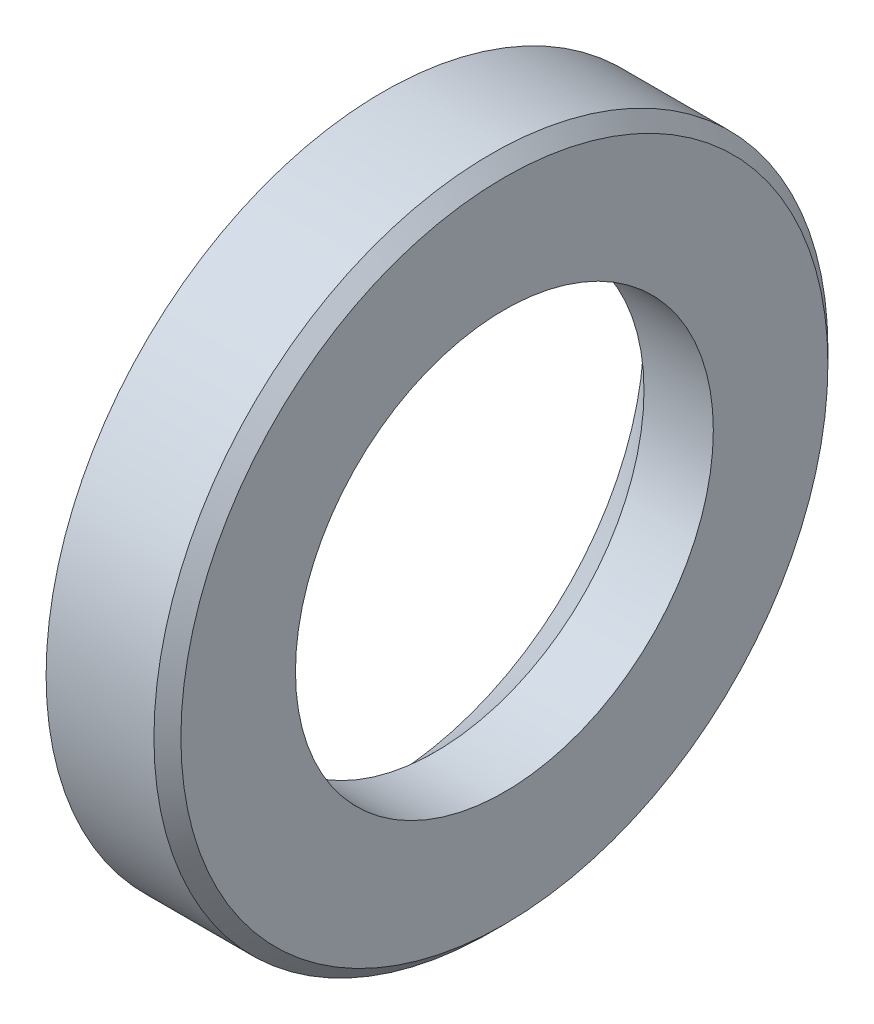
ISO-10303-21;
HEADER;
FILE_DESCRIPTION(('STEP AP214'),'2;1');
FILE_NAME('part.step','',(''),(''),'','','');
FILE_SCHEMA(('AUTOMOTIVE_DESIGN { 1 0 10303 214 1 1 1 1 }'));
ENDSEC;
DATA;
#1=APPLICATION_CONTEXT('core data for automotive mechanical design processes');
#2=APPLICATION_PROTOCOL_DEFINITION('international standard','automotive_design',2000,#1);
#3=PRODUCT_CONTEXT('',#1,'mechanical');
#4=PRODUCT('Part','Part','',(#3));
#5=PRODUCT_RELATED_PRODUCT_CATEGORY('part','',(#4));
#6=PRODUCT_DEFINITION_FORMATION('','',#4);
#7=PRODUCT_DEFINITION_CONTEXT('part definition',#1,'design');
#8=PRODUCT_DEFINITION('design','',#6,#7);
#9=PRODUCT_DEFINITION_SHAPE('','',#8);
#10=(LENGTH_UNIT() NAMED_UNIT(*) SI_UNIT(.MILLI.,.METRE.));
#11=(NAMED_UNIT(*) PLANE_ANGLE_UNIT() SI_UNIT($,.RADIAN.));
#12=(NAMED_UNIT(*) SI_UNIT($,.STERADIAN.) SOLID_ANGLE_UNIT());
#13=UNCERTAINTY_MEASURE_WITH_UNIT(LENGTH_MEASURE(1.E-05),#10,'distance_accuracy_value','');
#14=(GEOMETRIC_REPRESENTATION_CONTEXT(3) GLOBAL_UNCERTAINTY_ASSIGNED_CONTEXT((#13)) GLOBAL_UNIT_ASSIGNED_CONTEXT((#10,
#11,#12)) REPRESENTATION_CONTEXT('',''));
#15=CARTESIAN_POINT('',(0.,0.,0.));
#16=DIRECTION('',(0.,0.,1.));
#17=DIRECTION('',(1.,0.,0.));
#18=AXIS2_PLACEMENT_3D('',#15,#16,#17);
#19=CARTESIAN_POINT('',(2.74698076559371,-2.25,0.));
#20=DIRECTION('',(1.,0.,0.));
#21=DIRECTION('',(0.,0.,-1.));
#22=AXIS2_PLACEMENT_3D('',#19,#20,#21);
#23=CYLINDRICAL_SURFACE('',#22,3.1);
#24=CARTESIAN_POINT('',(2.3,-2.25,0.));
#25=DIRECTION('',(1.,0.,0.));
#26=DIRECTION('',(0.,0.,-1.));
#27=AXIS2_PLACEMENT_3D('',#24,#25,#26);
#28=CIRCLE('',#27,3.1);
#29=CARTESIAN_POINT('',(2.3,-2.25,-3.1));
#30=VERTEX_POINT('',#29);
#31=EDGE_CURVE('E45',#30,#30,#28,.T.);
#32=ORIENTED_EDGE('',*,*,#31,.T.);
#33=EDGE_LOOP('',(#32));
#34=FACE_BOUND('',#33,.T.);
#35=CARTESIAN_POINT('',(1.27132034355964,-2.25,0.));
#36=DIRECTION('',(1.,0.,0.));
#37=DIRECTION('',(0.,0.,-1.));
#38=AXIS2_PLACEMENT_3D('',#35,#36,#37);
#39=CIRCLE('',#38,3.1);
#40=CARTESIAN_POINT('',(1.27132034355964,-2.25,-3.1));
#41=VERTEX_POINT('',#40);
#42=EDGE_CURVE('E33',#41,#41,#39,.T.);
#43=ORIENTED_EDGE('',*,*,#42,.F.);
#44=EDGE_LOOP('',(#43));
#45=FACE_BOUND('',#44,.T.);
#46=ADVANCED_FACE('F23',(#34,#45),#23,.F.);
#47=CARTESIAN_POINT('',(0.500000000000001,-2.25,0.));
#48=DIRECTION('',(-1.,0.,0.));
#49=DIRECTION('',(0.,0.,1.));
#50=AXIS2_PLACEMENT_3D('',#47,#48,#49);
#51=CONICAL_SURFACE('',#50,3.87132034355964,0.78539816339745);
#52=ORIENTED_EDGE('',*,*,#42,.T.);
#53=EDGE_LOOP('',(#52));
#54=FACE_BOUND('',#53,.T.);
#55=CARTESIAN_POINT('',(0.500000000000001,-2.25,0.));
#56=DIRECTION('',(1.,0.,0.));
#57=DIRECTION('',(0.,0.,-1.));
#58=AXIS2_PLACEMENT_3D('',#55,#56,#57);
#59=CIRCLE('',#58,3.87132034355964);
#60=CARTESIAN_POINT('',(0.500000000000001,-2.25,-3.87132034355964));
#61=VERTEX_POINT('',#60);
#62=EDGE_CURVE('E37',#61,#61,#59,.T.);
#63=ORIENTED_EDGE('',*,*,#62,.F.);
#64=EDGE_LOOP('',(#63));
#65=FACE_BOUND('',#64,.T.);
#66=ADVANCED_FACE('F65',(#54,#65),#51,.F.);
#67=CARTESIAN_POINT('',(0.500000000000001,1.62132034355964,0.));
#68=DIRECTION('',(-1.,0.,0.));
#69=DIRECTION('',(0.,0.,1.));
#70=AXIS2_PLACEMENT_3D('',#67,#68,#69);
#71=PLANE('',#70);
#72=ORIENTED_EDGE('',*,*,#62,.T.);
#73=EDGE_LOOP('',(#72));
#74=FACE_BOUND('',#73,.T.);
#75=CARTESIAN_POINT('',(0.500000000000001,-2.25,0.));
#76=DIRECTION('',(1.,0.,0.));
#77=DIRECTION('',(0.,0.,-1.));
#78=AXIS2_PLACEMENT_3D('',#75,#76,#77);
#79=CIRCLE('',#78,5.);
#80=CARTESIAN_POINT('',(0.500000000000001,-2.25,-5.));
#81=VERTEX_POINT('',#80);
#82=EDGE_CURVE('E42',#81,#81,#79,.T.);
#83=ORIENTED_EDGE('',*,*,#82,.F.);
#84=EDGE_LOOP('',(#83));
#85=FACE_BOUND('',#84,.T.);
#86=ADVANCED_FACE('F62',(#74,#85),#71,.T.);
#87=CARTESIAN_POINT('',(2.74698076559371,-2.25,0.));
#88=DIRECTION('',(1.,0.,0.));
#89=DIRECTION('',(0.,0.,-1.));
#90=AXIS2_PLACEMENT_3D('',#87,#88,#89);
#91=CYLINDRICAL_SURFACE('',#90,5.);
#92=CARTESIAN_POINT('',(2.1,-2.25,0.));
#93=DIRECTION('',(1.,0.,0.));
#94=DIRECTION('',(0.,0.,-1.));
#95=AXIS2_PLACEMENT_3D('',#92,#93,#94);
#96=CIRCLE('',#95,5.);
#97=CARTESIAN_POINT('',(2.1,-2.25,-5.));
#98=VERTEX_POINT('',#97);
#99=EDGE_CURVE('E10',#98,#98,#96,.F.);
#100=ORIENTED_EDGE('',*,*,#99,.T.);
#101=EDGE_LOOP('',(#100));
#102=FACE_BOUND('',#101,.T.);
#103=ORIENTED_EDGE('',*,*,#82,.T.);
#104=EDGE_LOOP('',(#103));
#105=FACE_BOUND('',#104,.T.);
#106=ADVANCED_FACE('F54',(#102,#105),#91,.T.);
#107=CARTESIAN_POINT('',(2.3,0.85,0.));
#108=DIRECTION('',(1.,0.,0.));
#109=DIRECTION('',(0.,0.,-1.));
#110=AXIS2_PLACEMENT_3D('',#107,#108,#109);
#111=PLANE('',#110);
#112=CARTESIAN_POINT('',(2.3,-2.25,0.));
#113=DIRECTION('',(1.,0.,0.));
#114=DIRECTION('',(0.,0.,-1.));
#115=AXIS2_PLACEMENT_3D('',#112,#113,#114);
#116=CIRCLE('',#115,4.8);
#117=CARTESIAN_POINT('',(2.3,-2.25,-4.8));
#118=VERTEX_POINT('',#117);
#119=EDGE_CURVE('E29',#118,#118,#116,.T.);
#120=ORIENTED_EDGE('',*,*,#119,.T.);
#121=EDGE_LOOP('',(#120));
#122=FACE_BOUND('',#121,.T.);
#123=ORIENTED_EDGE('',*,*,#31,.F.);
#124=EDGE_LOOP('',(#123));
#125=FACE_BOUND('',#124,.T.);
#126=ADVANCED_FACE('F51',(#122,#125),#111,.T.);
#127=CARTESIAN_POINT('',(2.3,-2.25,0.));
#128=DIRECTION('',(-1.,0.,0.));
#129=DIRECTION('',(0.,0.,1.));
#130=AXIS2_PLACEMENT_3D('',#127,#128,#129);
#131=CONICAL_SURFACE('',#130,4.8,0.785398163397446);
#132=ORIENTED_EDGE('',*,*,#99,.F.);
#133=EDGE_LOOP('',(#132));
#134=FACE_BOUND('',#133,.T.);
#135=ORIENTED_EDGE('',*,*,#119,.F.);
#136=EDGE_LOOP('',(#135));
#137=FACE_BOUND('',#136,.T.);
#138=ADVANCED_FACE('F53',(#134,#137),#131,.T.);
#139=CLOSED_SHELL('',(#46,#66,#86,#106,#126,#138));
#140=MANIFOLD_SOLID_BREP('B2',#139);
#141=ADVANCED_BREP_SHAPE_REPRESENTATION('',(#18,#140),#14);
#142=SHAPE_DEFINITION_REPRESENTATION(#9,#141);
ENDSEC;
END-ISO-10303-21;
